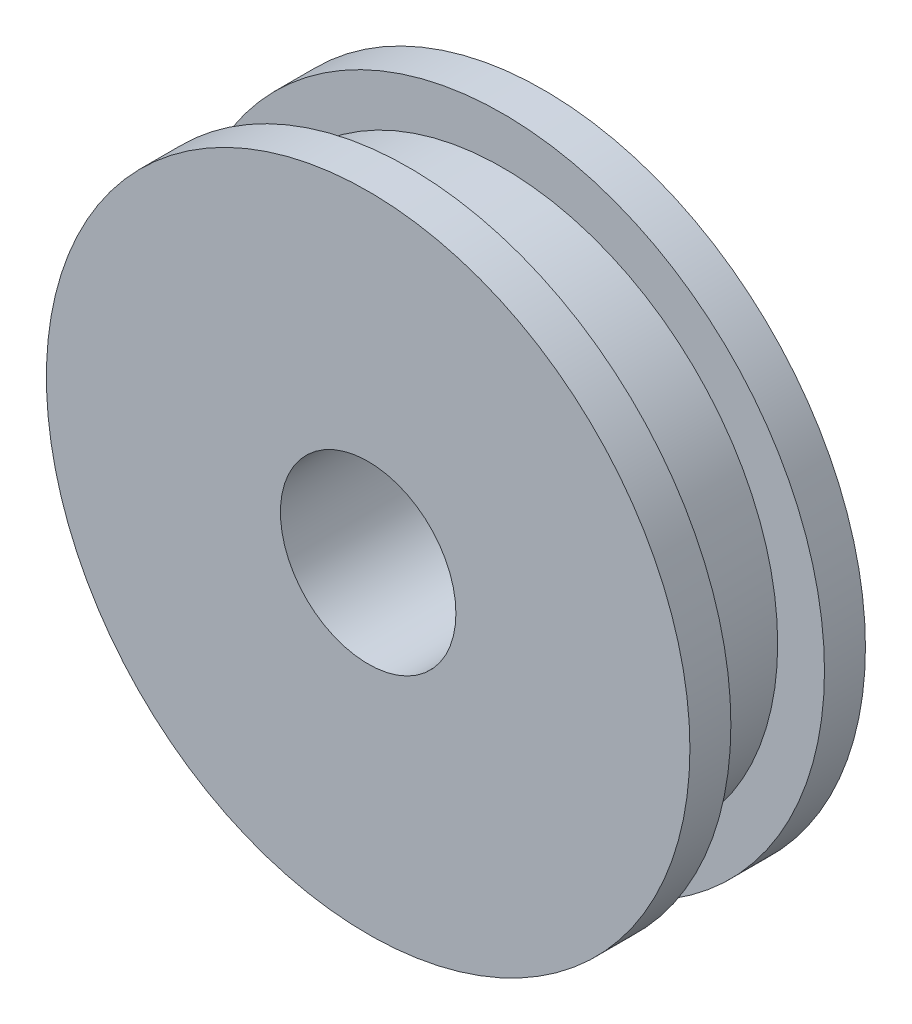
ISO-10303-21;
HEADER;
FILE_DESCRIPTION(('STEP AP214'),'2;1');
FILE_NAME('part.step','',(''),(''),'','','');
FILE_SCHEMA(('AUTOMOTIVE_DESIGN { 1 0 10303 214 1 1 1 1 }'));
ENDSEC;
DATA;
#1=APPLICATION_CONTEXT('core data for automotive mechanical design processes');
#2=APPLICATION_PROTOCOL_DEFINITION('international standard','automotive_design',2000,#1);
#3=PRODUCT_CONTEXT('',#1,'mechanical');
#4=PRODUCT('Part','Part','',(#3));
#5=PRODUCT_RELATED_PRODUCT_CATEGORY('part','',(#4));
#6=PRODUCT_DEFINITION_FORMATION('','',#4);
#7=PRODUCT_DEFINITION_CONTEXT('part definition',#1,'design');
#8=PRODUCT_DEFINITION('design','',#6,#7);
#9=PRODUCT_DEFINITION_SHAPE('','',#8);
#10=(LENGTH_UNIT() NAMED_UNIT(*) SI_UNIT(.MILLI.,.METRE.));
#11=(NAMED_UNIT(*) PLANE_ANGLE_UNIT() SI_UNIT($,.RADIAN.));
#12=(NAMED_UNIT(*) SI_UNIT($,.STERADIAN.) SOLID_ANGLE_UNIT());
#13=UNCERTAINTY_MEASURE_WITH_UNIT(LENGTH_MEASURE(1.E-05),#10,'distance_accuracy_value','');
#14=(GEOMETRIC_REPRESENTATION_CONTEXT(3) GLOBAL_UNCERTAINTY_ASSIGNED_CONTEXT((#13)) GLOBAL_UNIT_ASSIGNED_CONTEXT((#10,
#11,#12)) REPRESENTATION_CONTEXT('',''));
#15=CARTESIAN_POINT('',(0.,0.,0.));
#16=DIRECTION('',(0.,0.,1.));
#17=DIRECTION('',(1.,0.,0.));
#18=AXIS2_PLACEMENT_3D('',#15,#16,#17);
#19=CARTESIAN_POINT('',(0.,0.,1.5));
#20=DIRECTION('',(0.,0.,-1.));
#21=DIRECTION('',(-1.,0.,0.));
#22=AXIS2_PLACEMENT_3D('',#19,#20,#21);
#23=CYLINDRICAL_SURFACE('',#22,5.5);
#24=CARTESIAN_POINT('',(0.,0.,-0.8));
#25=DIRECTION('',(0.,0.,1.));
#26=DIRECTION('',(1.,0.,0.));
#27=AXIS2_PLACEMENT_3D('',#24,#25,#26);
#28=CIRCLE('',#27,5.5);
#29=CARTESIAN_POINT('',(5.5,0.,-0.8));
#30=VERTEX_POINT('',#29);
#31=EDGE_CURVE('E62',#30,#30,#28,.T.);
#32=ORIENTED_EDGE('',*,*,#31,.F.);
#33=EDGE_LOOP('',(#32));
#34=FACE_BOUND('',#33,.T.);
#35=CARTESIAN_POINT('',(0.,0.,-1.5));
#36=DIRECTION('',(0.,0.,1.));
#37=DIRECTION('',(1.,0.,0.));
#38=AXIS2_PLACEMENT_3D('',#35,#36,#37);
#39=CIRCLE('',#38,5.5);
#40=CARTESIAN_POINT('',(5.5,0.,-1.5));
#41=VERTEX_POINT('',#40);
#42=EDGE_CURVE('E39',#41,#41,#39,.T.);
#43=ORIENTED_EDGE('',*,*,#42,.T.);
#44=EDGE_LOOP('',(#43));
#45=FACE_BOUND('',#44,.T.);
#46=ADVANCED_FACE('F35',(#34,#45),#23,.T.);
#47=CARTESIAN_POINT('',(0.,0.,0.8));
#48=DIRECTION('',(0.,0.,1.));
#49=DIRECTION('',(1.,0.,0.));
#50=AXIS2_PLACEMENT_3D('',#47,#48,#49);
#51=CIRCLE('',#50,5.5);
#52=CARTESIAN_POINT('',(5.5,0.,0.8));
#53=VERTEX_POINT('',#52);
#54=EDGE_CURVE('E59',#53,#53,#51,.T.);
#55=ORIENTED_EDGE('',*,*,#54,.T.);
#56=EDGE_LOOP('',(#55));
#57=FACE_BOUND('',#56,.T.);
#58=CARTESIAN_POINT('',(0.,0.,1.5));
#59=DIRECTION('',(0.,0.,1.));
#60=DIRECTION('',(1.,0.,0.));
#61=AXIS2_PLACEMENT_3D('',#58,#59,#60);
#62=CIRCLE('',#61,5.5);
#63=CARTESIAN_POINT('',(5.5,0.,1.5));
#64=VERTEX_POINT('',#63);
#65=EDGE_CURVE('E10',#64,#64,#62,.T.);
#66=ORIENTED_EDGE('',*,*,#65,.F.);
#67=EDGE_LOOP('',(#66));
#68=FACE_BOUND('',#67,.T.);
#69=ADVANCED_FACE('F37',(#57,#68),#23,.T.);
#70=CARTESIAN_POINT('',(0.,0.,1.5));
#71=DIRECTION('',(0.,0.,1.));
#72=DIRECTION('',(1.,0.,0.));
#73=AXIS2_PLACEMENT_3D('',#70,#71,#72);
#74=PLANE('',#73);
#75=CARTESIAN_POINT('',(0.,0.,1.5));
#76=DIRECTION('',(0.,0.,1.));
#77=DIRECTION('',(1.,0.,0.));
#78=AXIS2_PLACEMENT_3D('',#75,#76,#77);
#79=CIRCLE('',#78,1.5);
#80=CARTESIAN_POINT('',(1.5,0.,1.5));
#81=VERTEX_POINT('',#80);
#82=EDGE_CURVE('E48',#81,#81,#79,.T.);
#83=ORIENTED_EDGE('',*,*,#82,.F.);
#84=EDGE_LOOP('',(#83));
#85=FACE_BOUND('',#84,.T.);
#86=ORIENTED_EDGE('',*,*,#65,.T.);
#87=EDGE_LOOP('',(#86));
#88=FACE_BOUND('',#87,.T.);
#89=ADVANCED_FACE('F75',(#85,#88),#74,.T.);
#90=CARTESIAN_POINT('',(0.,0.,-1.5));
#91=DIRECTION('',(0.,0.,1.));
#92=DIRECTION('',(1.,0.,0.));
#93=AXIS2_PLACEMENT_3D('',#90,#91,#92);
#94=PLANE('',#93);
#95=CARTESIAN_POINT('',(0.,0.,-1.5));
#96=DIRECTION('',(0.,0.,1.));
#97=DIRECTION('',(1.,0.,0.));
#98=AXIS2_PLACEMENT_3D('',#95,#96,#97);
#99=CIRCLE('',#98,1.5);
#100=CARTESIAN_POINT('',(1.5,0.,-1.5));
#101=VERTEX_POINT('',#100);
#102=EDGE_CURVE('E46',#101,#101,#99,.T.);
#103=ORIENTED_EDGE('',*,*,#102,.T.);
#104=EDGE_LOOP('',(#103));
#105=FACE_BOUND('',#104,.T.);
#106=ORIENTED_EDGE('',*,*,#42,.F.);
#107=EDGE_LOOP('',(#106));
#108=FACE_BOUND('',#107,.T.);
#109=ADVANCED_FACE('F72',(#105,#108),#94,.F.);
#110=CARTESIAN_POINT('',(0.,0.,-1.5));
#111=DIRECTION('',(0.,0.,1.));
#112=DIRECTION('',(1.,0.,0.));
#113=AXIS2_PLACEMENT_3D('',#110,#111,#112);
#114=CYLINDRICAL_SURFACE('',#113,1.5);
#115=ORIENTED_EDGE('',*,*,#102,.F.);
#116=EDGE_LOOP('',(#115));
#117=FACE_BOUND('',#116,.T.);
#118=ORIENTED_EDGE('',*,*,#82,.T.);
#119=EDGE_LOOP('',(#118));
#120=FACE_BOUND('',#119,.T.);
#121=ADVANCED_FACE('F74',(#117,#120),#114,.F.);
#122=CARTESIAN_POINT('',(4.7,0.,-0.8));
#123=DIRECTION('',(0.,0.,-1.));
#124=DIRECTION('',(-1.,0.,0.));
#125=AXIS2_PLACEMENT_3D('',#122,#123,#124);
#126=PLANE('',#125);
#127=CARTESIAN_POINT('',(0.,0.,-0.8));
#128=DIRECTION('',(0.,0.,1.));
#129=DIRECTION('',(1.,0.,0.));
#130=AXIS2_PLACEMENT_3D('',#127,#128,#129);
#131=CIRCLE('',#130,4.7);
#132=CARTESIAN_POINT('',(4.7,0.,-0.8));
#133=VERTEX_POINT('',#132);
#134=EDGE_CURVE('E51',#133,#133,#131,.T.);
#135=ORIENTED_EDGE('',*,*,#134,.F.);
#136=EDGE_LOOP('',(#135));
#137=FACE_BOUND('',#136,.T.);
#138=ORIENTED_EDGE('',*,*,#31,.T.);
#139=EDGE_LOOP('',(#138));
#140=FACE_BOUND('',#139,.T.);
#141=ADVANCED_FACE('F66',(#137,#140),#126,.F.);
#142=CARTESIAN_POINT('',(0.,0.,1.5));
#143=DIRECTION('',(0.,0.,1.));
#144=DIRECTION('',(1.,0.,0.));
#145=AXIS2_PLACEMENT_3D('',#142,#143,#144);
#146=CYLINDRICAL_SURFACE('',#145,4.7);
#147=CARTESIAN_POINT('',(0.,0.,0.8));
#148=DIRECTION('',(0.,0.,1.));
#149=DIRECTION('',(1.,0.,0.));
#150=AXIS2_PLACEMENT_3D('',#147,#148,#149);
#151=CIRCLE('',#150,4.7);
#152=CARTESIAN_POINT('',(4.7,0.,0.8));
#153=VERTEX_POINT('',#152);
#154=EDGE_CURVE('E56',#153,#153,#151,.T.);
#155=ORIENTED_EDGE('',*,*,#154,.F.);
#156=EDGE_LOOP('',(#155));
#157=FACE_BOUND('',#156,.T.);
#158=ORIENTED_EDGE('',*,*,#134,.T.);
#159=EDGE_LOOP('',(#158));
#160=FACE_BOUND('',#159,.T.);
#161=ADVANCED_FACE('F88',(#157,#160),#146,.T.);
#162=CARTESIAN_POINT('',(4.7,0.,0.8));
#163=DIRECTION('',(0.,0.,1.));
#164=DIRECTION('',(1.,0.,0.));
#165=AXIS2_PLACEMENT_3D('',#162,#163,#164);
#166=PLANE('',#165);
#167=ORIENTED_EDGE('',*,*,#54,.F.);
#168=EDGE_LOOP('',(#167));
#169=FACE_BOUND('',#168,.T.);
#170=ORIENTED_EDGE('',*,*,#154,.T.);
#171=EDGE_LOOP('',(#170));
#172=FACE_BOUND('',#171,.T.);
#173=ADVANCED_FACE('F92',(#169,#172),#166,.F.);
#174=CLOSED_SHELL('',(#46,#69,#89,#109,#121,#141,#161,#173));
#175=MANIFOLD_SOLID_BREP('B2',#174);
#176=ADVANCED_BREP_SHAPE_REPRESENTATION('',(#18,#175),#14);
#177=SHAPE_DEFINITION_REPRESENTATION(#9,#176);
ENDSEC;
END-ISO-10303-21;
